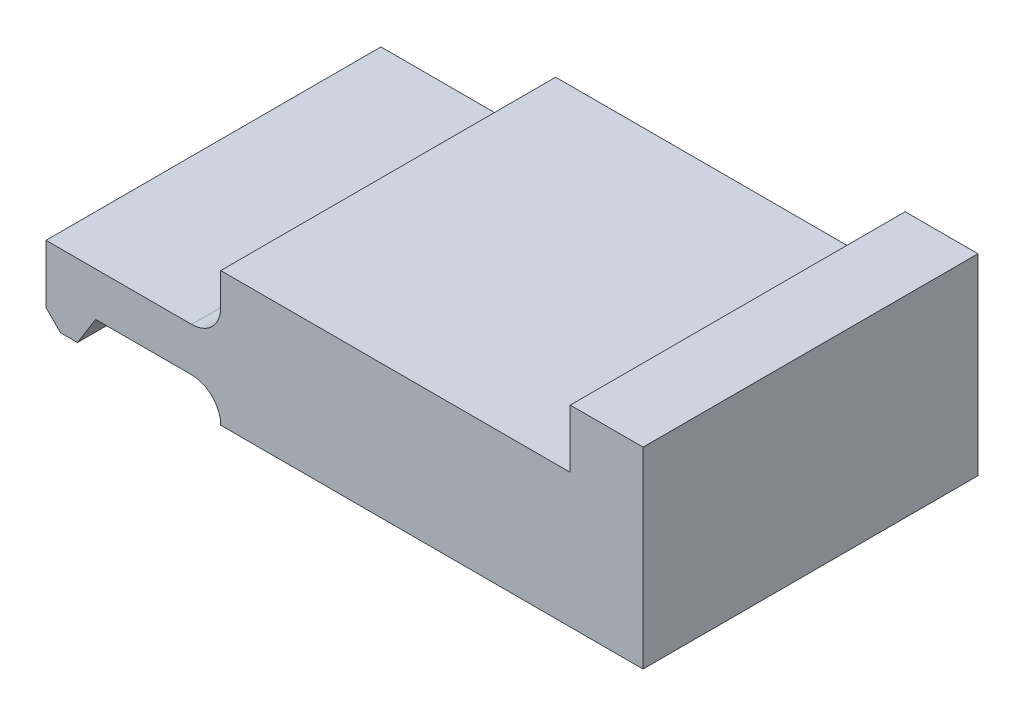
from build123d import *

# Parameters (mm, degrees)
BOSS_EXTRU_1_DEPTH = 5.75
ESQUISSE2_W        = 11.5
ESQUISSE2_H        = 6.6
BOSS_EXTRU_2_DEPTH = 2.5


with BuildPart() as part:
    # Esquisse1 → Boss.-Extru.1 (new, symmetric)
    with BuildSketch(Plane.XY):
        with BuildLine():
            Line((18, 4.6), (6, 4.6))
            Line((6, 4.6), (6, 3.5))
            ThreePointArc((6, 3.5), (5.707106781, 2.792893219), (5, 2.5))
            Line((5, 2.5), (0, 2.5))
            Line((0, 2.5), (0, 0.5))
            Line((0, 0.5), (0.5, 0))
            Line((0.5, 0), (1.080241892, 0))
            Line((1.080241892, 0), (1.704335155, 1))
            Line((1.704335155, 1), (5, 1))
            ThreePointArc((5, 1), (5.707106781, 0.707106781), (6, 0))
            Line((6, 0), (18, 0))
            Line((18, 0), (18, 4.6))
        make_face()
    extrude(amount=BOSS_EXTRU_1_DEPTH, both=True)

    # Esquisse2 → Boss.-Extru.2 (add)
    with BuildSketch(Plane(origin=(18, 0, 0), x_dir=(0, 0, -1), z_dir=(1, 0, 0))):
        with Locations((0, 3.3)):
            Rectangle(ESQUISSE2_W, ESQUISSE2_H)
    extrude(amount=BOSS_EXTRU_2_DEPTH)


solid = part.part
